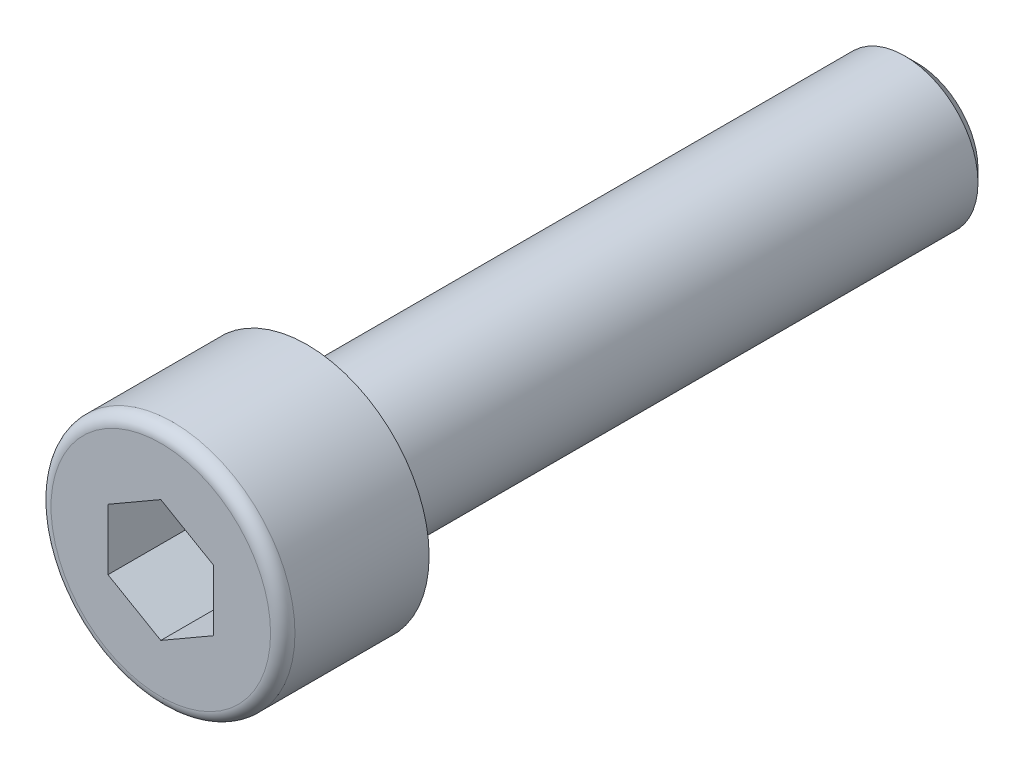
ISO-10303-21;
HEADER;
FILE_DESCRIPTION(('STEP AP214'),'2;1');
FILE_NAME('part.step','',(''),(''),'','','');
FILE_SCHEMA(('AUTOMOTIVE_DESIGN { 1 0 10303 214 1 1 1 1 }'));
ENDSEC;
DATA;
#1=APPLICATION_CONTEXT('core data for automotive mechanical design processes');
#2=APPLICATION_PROTOCOL_DEFINITION('international standard','automotive_design',2000,#1);
#3=PRODUCT_CONTEXT('',#1,'mechanical');
#4=PRODUCT('Part','Part','',(#3));
#5=PRODUCT_RELATED_PRODUCT_CATEGORY('part','',(#4));
#6=PRODUCT_DEFINITION_FORMATION('','',#4);
#7=PRODUCT_DEFINITION_CONTEXT('part definition',#1,'design');
#8=PRODUCT_DEFINITION('design','',#6,#7);
#9=PRODUCT_DEFINITION_SHAPE('','',#8);
#10=(LENGTH_UNIT() NAMED_UNIT(*) SI_UNIT(.MILLI.,.METRE.));
#11=(NAMED_UNIT(*) PLANE_ANGLE_UNIT() SI_UNIT($,.RADIAN.));
#12=(NAMED_UNIT(*) SI_UNIT($,.STERADIAN.) SOLID_ANGLE_UNIT());
#13=UNCERTAINTY_MEASURE_WITH_UNIT(LENGTH_MEASURE(1.E-05),#10,'distance_accuracy_value','');
#14=(GEOMETRIC_REPRESENTATION_CONTEXT(3) GLOBAL_UNCERTAINTY_ASSIGNED_CONTEXT((#13)) GLOBAL_UNIT_ASSIGNED_CONTEXT((#10,
#11,#12)) REPRESENTATION_CONTEXT('',''));
#15=CARTESIAN_POINT('',(0.,0.,0.));
#16=DIRECTION('',(0.,0.,1.));
#17=DIRECTION('',(1.,0.,0.));
#18=AXIS2_PLACEMENT_3D('',#15,#16,#17);
#19=CARTESIAN_POINT('',(0.,0.,25.));
#20=DIRECTION('',(0.,0.,-1.));
#21=DIRECTION('',(-1.,0.,0.));
#22=AXIS2_PLACEMENT_3D('',#19,#20,#21);
#23=CYLINDRICAL_SURFACE('',#22,3.);
#24=CARTESIAN_POINT('',(0.,0.,0.500000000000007));
#25=DIRECTION('',(0.,0.,1.));
#26=DIRECTION('',(1.,0.,0.));
#27=AXIS2_PLACEMENT_3D('',#24,#25,#26);
#28=CIRCLE('',#27,3.);
#29=CARTESIAN_POINT('',(3.,0.,0.500000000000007));
#30=VERTEX_POINT('',#29);
#31=EDGE_CURVE('E41',#30,#30,#28,.T.);
#32=ORIENTED_EDGE('',*,*,#31,.T.);
#33=EDGE_LOOP('',(#32));
#34=FACE_BOUND('',#33,.T.);
#35=CARTESIAN_POINT('',(0.,0.,25.));
#36=DIRECTION('',(0.,0.,1.));
#37=DIRECTION('',(1.,0.,0.));
#38=AXIS2_PLACEMENT_3D('',#35,#36,#37);
#39=CIRCLE('',#38,3.);
#40=CARTESIAN_POINT('',(3.,0.,25.));
#41=VERTEX_POINT('',#40);
#42=EDGE_CURVE('E144',#41,#41,#39,.T.);
#43=ORIENTED_EDGE('',*,*,#42,.F.);
#44=EDGE_LOOP('',(#43));
#45=FACE_BOUND('',#44,.T.);
#46=ADVANCED_FACE('F34',(#34,#45),#23,.T.);
#47=CARTESIAN_POINT('',(0.,0.,0.));
#48=DIRECTION('',(0.,0.,1.));
#49=DIRECTION('',(1.,0.,0.));
#50=AXIS2_PLACEMENT_3D('',#47,#48,#49);
#51=PLANE('',#50);
#52=CARTESIAN_POINT('',(0.,0.,0.));
#53=DIRECTION('',(0.,0.,1.));
#54=DIRECTION('',(1.,0.,0.));
#55=AXIS2_PLACEMENT_3D('',#52,#53,#54);
#56=CIRCLE('',#55,2.5);
#57=CARTESIAN_POINT('',(2.5,0.,0.));
#58=VERTEX_POINT('',#57);
#59=EDGE_CURVE('E11',#58,#58,#56,.F.);
#60=ORIENTED_EDGE('',*,*,#59,.T.);
#61=EDGE_LOOP('',(#60));
#62=FACE_BOUND('',#61,.T.);
#63=ADVANCED_FACE('F170',(#62),#51,.F.);
#64=CARTESIAN_POINT('',(0.,0.,25.));
#65=DIRECTION('',(0.,0.,1.));
#66=DIRECTION('',(1.,0.,0.));
#67=AXIS2_PLACEMENT_3D('',#64,#65,#66);
#68=PLANE('',#67);
#69=CARTESIAN_POINT('',(0.,0.,25.));
#70=DIRECTION('',(0.,0.,1.));
#71=DIRECTION('',(1.,0.,0.));
#72=AXIS2_PLACEMENT_3D('',#69,#70,#71);
#73=CIRCLE('',#72,5.);
#74=CARTESIAN_POINT('',(5.,0.,25.));
#75=VERTEX_POINT('',#74);
#76=EDGE_CURVE('E135',#75,#75,#73,.T.);
#77=ORIENTED_EDGE('',*,*,#76,.F.);
#78=EDGE_LOOP('',(#77));
#79=FACE_BOUND('',#78,.T.);
#80=ORIENTED_EDGE('',*,*,#42,.T.);
#81=EDGE_LOOP('',(#80));
#82=FACE_BOUND('',#81,.T.);
#83=ADVANCED_FACE('F174',(#79,#82),#68,.F.);
#84=CARTESIAN_POINT('',(0.,0.,31.));
#85=DIRECTION('',(0.,0.,-1.));
#86=DIRECTION('',(-1.,0.,0.));
#87=AXIS2_PLACEMENT_3D('',#84,#85,#86);
#88=CYLINDRICAL_SURFACE('',#87,5.);
#89=CARTESIAN_POINT('',(0.,0.,30.5));
#90=DIRECTION('',(0.,0.,1.));
#91=DIRECTION('',(1.,0.,0.));
#92=AXIS2_PLACEMENT_3D('',#89,#90,#91);
#93=CIRCLE('',#92,5.);
#94=CARTESIAN_POINT('',(5.,0.,30.5));
#95=VERTEX_POINT('',#94);
#96=EDGE_CURVE('E150',#95,#95,#93,.F.);
#97=ORIENTED_EDGE('',*,*,#96,.T.);
#98=EDGE_LOOP('',(#97));
#99=FACE_BOUND('',#98,.T.);
#100=ORIENTED_EDGE('',*,*,#76,.T.);
#101=EDGE_LOOP('',(#100));
#102=FACE_BOUND('',#101,.T.);
#103=ADVANCED_FACE('F179',(#99,#102),#88,.T.);
#104=CARTESIAN_POINT('',(0.,0.,31.));
#105=DIRECTION('',(0.,0.,1.));
#106=DIRECTION('',(1.,0.,0.));
#107=AXIS2_PLACEMENT_3D('',#104,#105,#106);
#108=PLANE('',#107);
#109=CARTESIAN_POINT('',(0.,0.,31.));
#110=DIRECTION('',(0.,0.,1.));
#111=DIRECTION('',(1.,0.,0.));
#112=AXIS2_PLACEMENT_3D('',#109,#110,#111);
#113=CIRCLE('',#112,4.5);
#114=CARTESIAN_POINT('',(4.5,0.,31.));
#115=VERTEX_POINT('',#114);
#116=EDGE_CURVE('E147',#115,#115,#113,.T.);
#117=ORIENTED_EDGE('',*,*,#116,.T.);
#118=EDGE_LOOP('',(#117));
#119=FACE_BOUND('',#118,.T.);
#120=DIRECTION('',(-0.866025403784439,0.5,0.));
#121=VECTOR('',#120,1.);
#122=CARTESIAN_POINT('',(2.1650635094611,1.25,31.));
#123=LINE('',#122,#121);
#124=CARTESIAN_POINT('',(2.1650635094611,1.25,31.));
#125=VERTEX_POINT('',#124);
#126=CARTESIAN_POINT('',(0.,2.5,31.));
#127=VERTEX_POINT('',#126);
#128=EDGE_CURVE('E48',#125,#127,#123,.T.);
#129=ORIENTED_EDGE('',*,*,#128,.F.);
#130=DIRECTION('',(0.,1.,0.));
#131=VECTOR('',#130,1.);
#132=CARTESIAN_POINT('',(2.1650635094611,-1.25,31.));
#133=LINE('',#132,#131);
#134=CARTESIAN_POINT('',(2.1650635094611,-1.25,31.));
#135=VERTEX_POINT('',#134);
#136=EDGE_CURVE('E117',#135,#125,#133,.T.);
#137=ORIENTED_EDGE('',*,*,#136,.F.);
#138=DIRECTION('',(0.866025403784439,0.5,0.));
#139=VECTOR('',#138,1.);
#140=CARTESIAN_POINT('',(0.,-2.5,31.));
#141=LINE('',#140,#139);
#142=CARTESIAN_POINT('',(0.,-2.5,31.));
#143=VERTEX_POINT('',#142);
#144=EDGE_CURVE('E111',#143,#135,#141,.T.);
#145=ORIENTED_EDGE('',*,*,#144,.F.);
#146=DIRECTION('',(0.866025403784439,-0.5,0.));
#147=VECTOR('',#146,1.);
#148=CARTESIAN_POINT('',(-2.1650635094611,-1.25,31.));
#149=LINE('',#148,#147);
#150=CARTESIAN_POINT('',(-2.1650635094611,-1.25,31.));
#151=VERTEX_POINT('',#150);
#152=EDGE_CURVE('E109',#151,#143,#149,.T.);
#153=ORIENTED_EDGE('',*,*,#152,.F.);
#154=DIRECTION('',(0.,-1.,0.));
#155=VECTOR('',#154,1.);
#156=CARTESIAN_POINT('',(-2.1650635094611,1.25,31.));
#157=LINE('',#156,#155);
#158=CARTESIAN_POINT('',(-2.1650635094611,1.25,31.));
#159=VERTEX_POINT('',#158);
#160=EDGE_CURVE('E91',#159,#151,#157,.T.);
#161=ORIENTED_EDGE('',*,*,#160,.F.);
#162=DIRECTION('',(-0.866025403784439,-0.5,0.));
#163=VECTOR('',#162,1.);
#164=CARTESIAN_POINT('',(0.,2.5,31.));
#165=LINE('',#164,#163);
#166=EDGE_CURVE('E102',#127,#159,#165,.T.);
#167=ORIENTED_EDGE('',*,*,#166,.F.);
#168=EDGE_LOOP('',(#129,#137,#145,#153,#161,#167));
#169=FACE_BOUND('',#168,.T.);
#170=ADVANCED_FACE('F106',(#119,#169),#108,.T.);
#171=CARTESIAN_POINT('',(2.1650635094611,1.25,27.5));
#172=DIRECTION('',(0.5,0.866025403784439,0.));
#173=DIRECTION('',(-0.866025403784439,0.5,0.));
#174=AXIS2_PLACEMENT_3D('',#171,#172,#173);
#175=PLANE('',#174);
#176=ORIENTED_EDGE('',*,*,#128,.T.);
#177=DIRECTION('',(0.,0.,1.));
#178=VECTOR('',#177,1.);
#179=CARTESIAN_POINT('',(0.,2.5,27.5));
#180=LINE('',#179,#178);
#181=CARTESIAN_POINT('',(0.,2.5,27.5));
#182=VERTEX_POINT('',#181);
#183=EDGE_CURVE('E99',#182,#127,#180,.T.);
#184=ORIENTED_EDGE('',*,*,#183,.F.);
#185=DIRECTION('',(-0.866025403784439,0.5,0.));
#186=VECTOR('',#185,1.);
#187=CARTESIAN_POINT('',(2.1650635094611,1.25,27.5));
#188=LINE('',#187,#186);
#189=CARTESIAN_POINT('',(2.1650635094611,1.25,27.5));
#190=VERTEX_POINT('',#189);
#191=EDGE_CURVE('E119',#190,#182,#188,.T.);
#192=ORIENTED_EDGE('',*,*,#191,.F.);
#193=DIRECTION('',(0.,0.,1.));
#194=VECTOR('',#193,1.);
#195=CARTESIAN_POINT('',(2.1650635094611,1.25,27.5));
#196=LINE('',#195,#194);
#197=EDGE_CURVE('E55',#190,#125,#196,.T.);
#198=ORIENTED_EDGE('',*,*,#197,.T.);
#199=EDGE_LOOP('',(#176,#184,#192,#198));
#200=FACE_BOUND('',#199,.T.);
#201=ADVANCED_FACE('F187',(#200),#175,.F.);
#202=CARTESIAN_POINT('',(2.1650635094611,-1.25,27.5));
#203=DIRECTION('',(1.,0.,0.));
#204=DIRECTION('',(0.,1.,0.));
#205=AXIS2_PLACEMENT_3D('',#202,#203,#204);
#206=PLANE('',#205);
#207=ORIENTED_EDGE('',*,*,#136,.T.);
#208=ORIENTED_EDGE('',*,*,#197,.F.);
#209=DIRECTION('',(0.,1.,0.));
#210=VECTOR('',#209,1.);
#211=CARTESIAN_POINT('',(2.1650635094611,-1.25,27.5));
#212=LINE('',#211,#210);
#213=CARTESIAN_POINT('',(2.1650635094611,-1.25,27.5));
#214=VERTEX_POINT('',#213);
#215=EDGE_CURVE('E131',#214,#190,#212,.T.);
#216=ORIENTED_EDGE('',*,*,#215,.F.);
#217=DIRECTION('',(0.,0.,1.));
#218=VECTOR('',#217,1.);
#219=CARTESIAN_POINT('',(2.1650635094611,-1.25,27.5));
#220=LINE('',#219,#218);
#221=EDGE_CURVE('E136',#214,#135,#220,.T.);
#222=ORIENTED_EDGE('',*,*,#221,.T.);
#223=EDGE_LOOP('',(#207,#208,#216,#222));
#224=FACE_BOUND('',#223,.T.);
#225=ADVANCED_FACE('F192',(#224),#206,.F.);
#226=CARTESIAN_POINT('',(0.,-2.5,27.5));
#227=DIRECTION('',(0.5,-0.866025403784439,0.));
#228=DIRECTION('',(0.866025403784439,0.5,0.));
#229=AXIS2_PLACEMENT_3D('',#226,#227,#228);
#230=PLANE('',#229);
#231=ORIENTED_EDGE('',*,*,#144,.T.);
#232=ORIENTED_EDGE('',*,*,#221,.F.);
#233=DIRECTION('',(0.866025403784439,0.5,0.));
#234=VECTOR('',#233,1.);
#235=CARTESIAN_POINT('',(0.,-2.5,27.5));
#236=LINE('',#235,#234);
#237=CARTESIAN_POINT('',(0.,-2.5,27.5));
#238=VERTEX_POINT('',#237);
#239=EDGE_CURVE('E128',#238,#214,#236,.T.);
#240=ORIENTED_EDGE('',*,*,#239,.F.);
#241=DIRECTION('',(0.,0.,1.));
#242=VECTOR('',#241,1.);
#243=CARTESIAN_POINT('',(0.,-2.5,27.5));
#244=LINE('',#243,#242);
#245=EDGE_CURVE('E138',#238,#143,#244,.T.);
#246=ORIENTED_EDGE('',*,*,#245,.T.);
#247=EDGE_LOOP('',(#231,#232,#240,#246));
#248=FACE_BOUND('',#247,.T.);
#249=ADVANCED_FACE('F200',(#248),#230,.F.);
#250=CARTESIAN_POINT('',(-2.1650635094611,-1.25,27.5));
#251=DIRECTION('',(-0.5,-0.866025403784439,0.));
#252=DIRECTION('',(0.866025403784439,-0.5,0.));
#253=AXIS2_PLACEMENT_3D('',#250,#251,#252);
#254=PLANE('',#253);
#255=ORIENTED_EDGE('',*,*,#152,.T.);
#256=ORIENTED_EDGE('',*,*,#245,.F.);
#257=DIRECTION('',(0.866025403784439,-0.5,0.));
#258=VECTOR('',#257,1.);
#259=CARTESIAN_POINT('',(-2.1650635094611,-1.25,27.5));
#260=LINE('',#259,#258);
#261=CARTESIAN_POINT('',(-2.1650635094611,-1.25,27.5));
#262=VERTEX_POINT('',#261);
#263=EDGE_CURVE('E125',#262,#238,#260,.T.);
#264=ORIENTED_EDGE('',*,*,#263,.F.);
#265=DIRECTION('',(0.,0.,1.));
#266=VECTOR('',#265,1.);
#267=CARTESIAN_POINT('',(-2.1650635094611,-1.25,27.5));
#268=LINE('',#267,#266);
#269=EDGE_CURVE('E98',#262,#151,#268,.T.);
#270=ORIENTED_EDGE('',*,*,#269,.T.);
#271=EDGE_LOOP('',(#255,#256,#264,#270));
#272=FACE_BOUND('',#271,.T.);
#273=ADVANCED_FACE('F197',(#272),#254,.F.);
#274=CARTESIAN_POINT('',(-2.1650635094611,1.25,27.5));
#275=DIRECTION('',(-1.,0.,0.));
#276=DIRECTION('',(0.,-1.,0.));
#277=AXIS2_PLACEMENT_3D('',#274,#275,#276);
#278=PLANE('',#277);
#279=ORIENTED_EDGE('',*,*,#160,.T.);
#280=ORIENTED_EDGE('',*,*,#269,.F.);
#281=DIRECTION('',(0.,-1.,0.));
#282=VECTOR('',#281,1.);
#283=CARTESIAN_POINT('',(-2.1650635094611,1.25,27.5));
#284=LINE('',#283,#282);
#285=CARTESIAN_POINT('',(-2.1650635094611,1.25,27.5));
#286=VERTEX_POINT('',#285);
#287=EDGE_CURVE('E94',#286,#262,#284,.T.);
#288=ORIENTED_EDGE('',*,*,#287,.F.);
#289=DIRECTION('',(0.,0.,1.));
#290=VECTOR('',#289,1.);
#291=CARTESIAN_POINT('',(-2.1650635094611,1.25,27.5));
#292=LINE('',#291,#290);
#293=EDGE_CURVE('E87',#286,#159,#292,.T.);
#294=ORIENTED_EDGE('',*,*,#293,.T.);
#295=EDGE_LOOP('',(#279,#280,#288,#294));
#296=FACE_BOUND('',#295,.T.);
#297=ADVANCED_FACE('F89',(#296),#278,.F.);
#298=CARTESIAN_POINT('',(0.,2.5,27.5));
#299=DIRECTION('',(-0.5,0.866025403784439,0.));
#300=DIRECTION('',(-0.866025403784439,-0.5,0.));
#301=AXIS2_PLACEMENT_3D('',#298,#299,#300);
#302=PLANE('',#301);
#303=ORIENTED_EDGE('',*,*,#166,.T.);
#304=ORIENTED_EDGE('',*,*,#293,.F.);
#305=DIRECTION('',(-0.866025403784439,-0.5,0.));
#306=VECTOR('',#305,1.);
#307=CARTESIAN_POINT('',(0.,2.5,27.5));
#308=LINE('',#307,#306);
#309=EDGE_CURVE('E122',#182,#286,#308,.T.);
#310=ORIENTED_EDGE('',*,*,#309,.F.);
#311=ORIENTED_EDGE('',*,*,#183,.T.);
#312=EDGE_LOOP('',(#303,#304,#310,#311));
#313=FACE_BOUND('',#312,.T.);
#314=ADVANCED_FACE('F103',(#313),#302,.F.);
#315=CARTESIAN_POINT('',(2.1650635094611,1.25,27.5));
#316=DIRECTION('',(0.,0.,-1.));
#317=DIRECTION('',(-1.,0.,0.));
#318=AXIS2_PLACEMENT_3D('',#315,#316,#317);
#319=PLANE('',#318);
#320=ORIENTED_EDGE('',*,*,#191,.T.);
#321=ORIENTED_EDGE('',*,*,#309,.T.);
#322=ORIENTED_EDGE('',*,*,#287,.T.);
#323=ORIENTED_EDGE('',*,*,#263,.T.);
#324=ORIENTED_EDGE('',*,*,#239,.T.);
#325=ORIENTED_EDGE('',*,*,#215,.T.);
#326=EDGE_LOOP('',(#320,#321,#322,#323,#324,#325));
#327=FACE_BOUND('',#326,.T.);
#328=ADVANCED_FACE('F165',(#327),#319,.F.);
#329=CARTESIAN_POINT('',(0.,0.,30.5));
#330=DIRECTION('',(0.,0.,1.));
#331=DIRECTION('',(1.,0.,0.));
#332=AXIS2_PLACEMENT_3D('',#329,#330,#331);
#333=TOROIDAL_SURFACE('',#332,4.5,0.5);
#334=ORIENTED_EDGE('',*,*,#96,.F.);
#335=EDGE_LOOP('',(#334));
#336=FACE_BOUND('',#335,.T.);
#337=ORIENTED_EDGE('',*,*,#116,.F.);
#338=EDGE_LOOP('',(#337));
#339=FACE_BOUND('',#338,.T.);
#340=ADVANCED_FACE('F159',(#336,#339),#333,.T.);
#341=CARTESIAN_POINT('',(0.,0.,0.500000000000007));
#342=DIRECTION('',(0.,0.,1.));
#343=DIRECTION('',(1.,0.,0.));
#344=AXIS2_PLACEMENT_3D('',#341,#342,#343);
#345=CONICAL_SURFACE('',#344,3.,0.785398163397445);
#346=ORIENTED_EDGE('',*,*,#59,.F.);
#347=EDGE_LOOP('',(#346));
#348=FACE_BOUND('',#347,.T.);
#349=ORIENTED_EDGE('',*,*,#31,.F.);
#350=EDGE_LOOP('',(#349));
#351=FACE_BOUND('',#350,.T.);
#352=ADVANCED_FACE('F157',(#348,#351),#345,.T.);
#353=CLOSED_SHELL('',(#46,#63,#83,#103,#170,#201,#225,#249,#273,#297,#314,#328,#340,#352));
#354=MANIFOLD_SOLID_BREP('B2',#353);
#355=ADVANCED_BREP_SHAPE_REPRESENTATION('',(#18,#354),#14);
#356=SHAPE_DEFINITION_REPRESENTATION(#9,#355);
ENDSEC;
END-ISO-10303-21;
